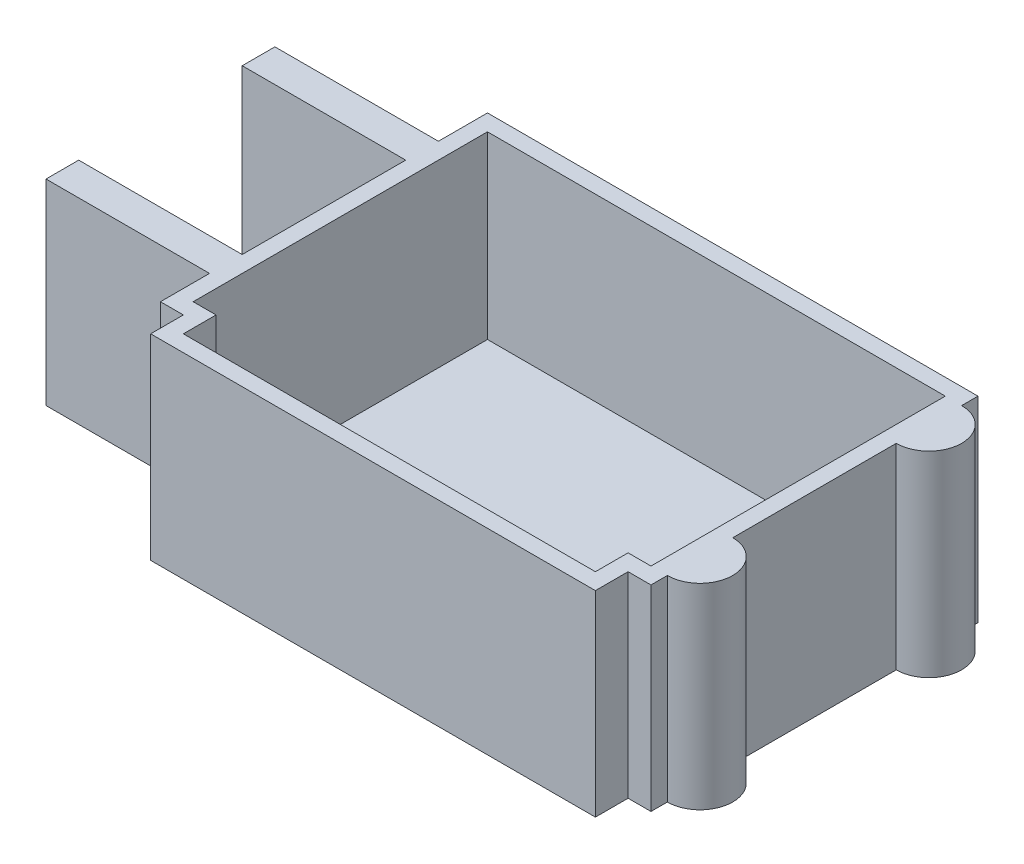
ISO-10303-21;
HEADER;
FILE_DESCRIPTION(('STEP AP214'),'2;1');
FILE_NAME('part.step','',(''),(''),'','','');
FILE_SCHEMA(('AUTOMOTIVE_DESIGN { 1 0 10303 214 1 1 1 1 }'));
ENDSEC;
DATA;
#1=APPLICATION_CONTEXT('core data for automotive mechanical design processes');
#2=APPLICATION_PROTOCOL_DEFINITION('international standard','automotive_design',2000,#1);
#3=PRODUCT_CONTEXT('',#1,'mechanical');
#4=PRODUCT('Part','Part','',(#3));
#5=PRODUCT_RELATED_PRODUCT_CATEGORY('part','',(#4));
#6=PRODUCT_DEFINITION_FORMATION('','',#4);
#7=PRODUCT_DEFINITION_CONTEXT('part definition',#1,'design');
#8=PRODUCT_DEFINITION('design','',#6,#7);
#9=PRODUCT_DEFINITION_SHAPE('','',#8);
#10=(LENGTH_UNIT() NAMED_UNIT(*) SI_UNIT(.MILLI.,.METRE.));
#11=(NAMED_UNIT(*) PLANE_ANGLE_UNIT() SI_UNIT($,.RADIAN.));
#12=(NAMED_UNIT(*) SI_UNIT($,.STERADIAN.) SOLID_ANGLE_UNIT());
#13=UNCERTAINTY_MEASURE_WITH_UNIT(LENGTH_MEASURE(1.E-05),#10,'distance_accuracy_value','');
#14=(GEOMETRIC_REPRESENTATION_CONTEXT(3) GLOBAL_UNCERTAINTY_ASSIGNED_CONTEXT((#13)) GLOBAL_UNIT_ASSIGNED_CONTEXT((#10,
#11,#12)) REPRESENTATION_CONTEXT('',''));
#15=CARTESIAN_POINT('',(0.,0.,0.));
#16=DIRECTION('',(0.,0.,1.));
#17=DIRECTION('',(1.,0.,0.));
#18=AXIS2_PLACEMENT_3D('',#15,#16,#17);
#19=CARTESIAN_POINT('',(-75.,60.,-50.));
#20=DIRECTION('',(1.,0.,0.));
#21=DIRECTION('',(0.,0.,-1.));
#22=AXIS2_PLACEMENT_3D('',#19,#20,#21);
#23=PLANE('',#22);
#24=DIRECTION('',(0.,0.,1.));
#25=VECTOR('',#24,1.);
#26=CARTESIAN_POINT('',(-75.,0.,-50.));
#27=LINE('',#26,#25);
#28=CARTESIAN_POINT('',(-75.,0.,-50.));
#29=VERTEX_POINT('',#28);
#30=CARTESIAN_POINT('',(-75.,0.,-35.));
#31=VERTEX_POINT('',#30);
#32=EDGE_CURVE('E211',#29,#31,#27,.T.);
#33=ORIENTED_EDGE('',*,*,#32,.T.);
#34=DIRECTION('',(0.,-1.,0.));
#35=VECTOR('',#34,1.);
#36=CARTESIAN_POINT('',(-75.,60.,-35.));
#37=LINE('',#36,#35);
#38=CARTESIAN_POINT('',(-75.,60.,-35.));
#39=VERTEX_POINT('',#38);
#40=EDGE_CURVE('E11',#39,#31,#37,.T.);
#41=ORIENTED_EDGE('',*,*,#40,.F.);
#42=DIRECTION('',(0.,0.,1.));
#43=VECTOR('',#42,1.);
#44=CARTESIAN_POINT('',(-75.,60.,-50.));
#45=LINE('',#44,#43);
#46=CARTESIAN_POINT('',(-75.,60.,-50.));
#47=VERTEX_POINT('',#46);
#48=EDGE_CURVE('E251',#47,#39,#45,.T.);
#49=ORIENTED_EDGE('',*,*,#48,.F.);
#50=DIRECTION('',(0.,-1.,0.));
#51=VECTOR('',#50,1.);
#52=CARTESIAN_POINT('',(-75.,60.,-50.));
#53=LINE('',#52,#51);
#54=EDGE_CURVE('E207',#47,#29,#53,.T.);
#55=ORIENTED_EDGE('',*,*,#54,.T.);
#56=EDGE_LOOP('',(#33,#41,#49,#55));
#57=FACE_BOUND('',#56,.T.);
#58=ADVANCED_FACE('F32',(#57),#23,.F.);
#59=CARTESIAN_POINT('',(-75.,60.,-35.));
#60=DIRECTION('',(0.,0.,1.));
#61=DIRECTION('',(1.,0.,0.));
#62=AXIS2_PLACEMENT_3D('',#59,#60,#61);
#63=PLANE('',#62);
#64=DIRECTION('',(-1.,0.,0.));
#65=VECTOR('',#64,1.);
#66=CARTESIAN_POINT('',(-75.,0.,-35.));
#67=LINE('',#66,#65);
#68=CARTESIAN_POINT('',(-125.,0.,-35.));
#69=VERTEX_POINT('',#68);
#70=EDGE_CURVE('E214',#31,#69,#67,.T.);
#71=ORIENTED_EDGE('',*,*,#70,.T.);
#72=DIRECTION('',(0.,-1.,0.));
#73=VECTOR('',#72,1.);
#74=CARTESIAN_POINT('',(-125.,60.,-35.));
#75=LINE('',#74,#73);
#76=CARTESIAN_POINT('',(-125.,60.,-35.));
#77=VERTEX_POINT('',#76);
#78=EDGE_CURVE('E39',#77,#69,#75,.T.);
#79=ORIENTED_EDGE('',*,*,#78,.F.);
#80=DIRECTION('',(-1.,0.,0.));
#81=VECTOR('',#80,1.);
#82=CARTESIAN_POINT('',(-75.,60.,-35.));
#83=LINE('',#82,#81);
#84=EDGE_CURVE('E132',#39,#77,#83,.T.);
#85=ORIENTED_EDGE('',*,*,#84,.F.);
#86=ORIENTED_EDGE('',*,*,#40,.T.);
#87=EDGE_LOOP('',(#71,#79,#85,#86));
#88=FACE_BOUND('',#87,.T.);
#89=ADVANCED_FACE('F504',(#88),#63,.F.);
#90=CARTESIAN_POINT('',(-125.,60.,-35.));
#91=DIRECTION('',(1.,0.,0.));
#92=DIRECTION('',(0.,0.,-1.));
#93=AXIS2_PLACEMENT_3D('',#90,#91,#92);
#94=PLANE('',#93);
#95=DIRECTION('',(0.,0.,1.));
#96=VECTOR('',#95,1.);
#97=CARTESIAN_POINT('',(-125.,0.,-35.));
#98=LINE('',#97,#96);
#99=CARTESIAN_POINT('',(-125.,0.,-25.));
#100=VERTEX_POINT('',#99);
#101=EDGE_CURVE('E217',#69,#100,#98,.T.);
#102=ORIENTED_EDGE('',*,*,#101,.T.);
#103=DIRECTION('',(0.,-1.,0.));
#104=VECTOR('',#103,1.);
#105=CARTESIAN_POINT('',(-125.,60.,-25.));
#106=LINE('',#105,#104);
#107=CARTESIAN_POINT('',(-125.,60.,-25.));
#108=VERTEX_POINT('',#107);
#109=EDGE_CURVE('E294',#108,#100,#106,.T.);
#110=ORIENTED_EDGE('',*,*,#109,.F.);
#111=DIRECTION('',(0.,0.,1.));
#112=VECTOR('',#111,1.);
#113=CARTESIAN_POINT('',(-125.,60.,-35.));
#114=LINE('',#113,#112);
#115=EDGE_CURVE('E302',#77,#108,#114,.T.);
#116=ORIENTED_EDGE('',*,*,#115,.F.);
#117=ORIENTED_EDGE('',*,*,#78,.T.);
#118=EDGE_LOOP('',(#102,#110,#116,#117));
#119=FACE_BOUND('',#118,.T.);
#120=ADVANCED_FACE('F300',(#119),#94,.F.);
#121=CARTESIAN_POINT('',(-75.,60.,-25.));
#122=DIRECTION('',(0.,0.,-1.));
#123=DIRECTION('',(-1.,0.,0.));
#124=AXIS2_PLACEMENT_3D('',#121,#122,#123);
#125=PLANE('',#124);
#126=DIRECTION('',(1.,0.,0.));
#127=VECTOR('',#126,1.);
#128=CARTESIAN_POINT('',(-75.,0.,-25.));
#129=LINE('',#128,#127);
#130=CARTESIAN_POINT('',(-75.,0.,-25.));
#131=VERTEX_POINT('',#130);
#132=EDGE_CURVE('E219',#100,#131,#129,.T.);
#133=ORIENTED_EDGE('',*,*,#132,.T.);
#134=DIRECTION('',(0.,-1.,0.));
#135=VECTOR('',#134,1.);
#136=CARTESIAN_POINT('',(-75.,60.,-25.));
#137=LINE('',#136,#135);
#138=CARTESIAN_POINT('',(-75.,60.,-25.));
#139=VERTEX_POINT('',#138);
#140=EDGE_CURVE('E291',#139,#131,#137,.T.);
#141=ORIENTED_EDGE('',*,*,#140,.F.);
#142=DIRECTION('',(1.,0.,0.));
#143=VECTOR('',#142,1.);
#144=CARTESIAN_POINT('',(-75.,60.,-25.));
#145=LINE('',#144,#143);
#146=EDGE_CURVE('E320',#108,#139,#145,.T.);
#147=ORIENTED_EDGE('',*,*,#146,.F.);
#148=ORIENTED_EDGE('',*,*,#109,.T.);
#149=EDGE_LOOP('',(#133,#141,#147,#148));
#150=FACE_BOUND('',#149,.T.);
#151=ADVANCED_FACE('F311',(#150),#125,.F.);
#152=CARTESIAN_POINT('',(-75.,60.,-25.));
#153=DIRECTION('',(1.,0.,0.));
#154=DIRECTION('',(0.,0.,-1.));
#155=AXIS2_PLACEMENT_3D('',#152,#153,#154);
#156=PLANE('',#155);
#157=DIRECTION('',(0.,0.,1.));
#158=VECTOR('',#157,1.);
#159=CARTESIAN_POINT('',(-75.,0.,-25.));
#160=LINE('',#159,#158);
#161=CARTESIAN_POINT('',(-75.,0.,25.));
#162=VERTEX_POINT('',#161);
#163=EDGE_CURVE('E221',#131,#162,#160,.T.);
#164=ORIENTED_EDGE('',*,*,#163,.T.);
#165=DIRECTION('',(0.,-1.,0.));
#166=VECTOR('',#165,1.);
#167=CARTESIAN_POINT('',(-75.,60.,25.));
#168=LINE('',#167,#166);
#169=CARTESIAN_POINT('',(-75.,60.,25.));
#170=VERTEX_POINT('',#169);
#171=EDGE_CURVE('E288',#170,#162,#168,.T.);
#172=ORIENTED_EDGE('',*,*,#171,.F.);
#173=DIRECTION('',(0.,0.,1.));
#174=VECTOR('',#173,1.);
#175=CARTESIAN_POINT('',(-75.,60.,-25.));
#176=LINE('',#175,#174);
#177=EDGE_CURVE('E317',#139,#170,#176,.T.);
#178=ORIENTED_EDGE('',*,*,#177,.F.);
#179=ORIENTED_EDGE('',*,*,#140,.T.);
#180=EDGE_LOOP('',(#164,#172,#178,#179));
#181=FACE_BOUND('',#180,.T.);
#182=ADVANCED_FACE('F315',(#181),#156,.F.);
#183=CARTESIAN_POINT('',(-75.,60.,25.));
#184=DIRECTION('',(0.,0.,1.));
#185=DIRECTION('',(1.,0.,0.));
#186=AXIS2_PLACEMENT_3D('',#183,#184,#185);
#187=PLANE('',#186);
#188=DIRECTION('',(-1.,0.,0.));
#189=VECTOR('',#188,1.);
#190=CARTESIAN_POINT('',(-75.,0.,25.));
#191=LINE('',#190,#189);
#192=CARTESIAN_POINT('',(-125.,0.,25.));
#193=VERTEX_POINT('',#192);
#194=EDGE_CURVE('E223',#162,#193,#191,.T.);
#195=ORIENTED_EDGE('',*,*,#194,.T.);
#196=DIRECTION('',(0.,-1.,0.));
#197=VECTOR('',#196,1.);
#198=CARTESIAN_POINT('',(-125.,60.,25.));
#199=LINE('',#198,#197);
#200=CARTESIAN_POINT('',(-125.,60.,25.));
#201=VERTEX_POINT('',#200);
#202=EDGE_CURVE('E285',#201,#193,#199,.T.);
#203=ORIENTED_EDGE('',*,*,#202,.F.);
#204=DIRECTION('',(-1.,0.,0.));
#205=VECTOR('',#204,1.);
#206=CARTESIAN_POINT('',(-75.,60.,25.));
#207=LINE('',#206,#205);
#208=EDGE_CURVE('E319',#170,#201,#207,.T.);
#209=ORIENTED_EDGE('',*,*,#208,.F.);
#210=ORIENTED_EDGE('',*,*,#171,.T.);
#211=EDGE_LOOP('',(#195,#203,#209,#210));
#212=FACE_BOUND('',#211,.T.);
#213=ADVANCED_FACE('F517',(#212),#187,.F.);
#214=CARTESIAN_POINT('',(-125.,60.,35.));
#215=DIRECTION('',(1.,0.,0.));
#216=DIRECTION('',(0.,0.,-1.));
#217=AXIS2_PLACEMENT_3D('',#214,#215,#216);
#218=PLANE('',#217);
#219=DIRECTION('',(0.,0.,1.));
#220=VECTOR('',#219,1.);
#221=CARTESIAN_POINT('',(-125.,0.,35.));
#222=LINE('',#221,#220);
#223=CARTESIAN_POINT('',(-125.,0.,35.));
#224=VERTEX_POINT('',#223);
#225=EDGE_CURVE('E225',#193,#224,#222,.T.);
#226=ORIENTED_EDGE('',*,*,#225,.T.);
#227=DIRECTION('',(0.,-1.,0.));
#228=VECTOR('',#227,1.);
#229=CARTESIAN_POINT('',(-125.,60.,35.));
#230=LINE('',#229,#228);
#231=CARTESIAN_POINT('',(-125.,60.,35.));
#232=VERTEX_POINT('',#231);
#233=EDGE_CURVE('E282',#232,#224,#230,.T.);
#234=ORIENTED_EDGE('',*,*,#233,.F.);
#235=DIRECTION('',(0.,0.,1.));
#236=VECTOR('',#235,1.);
#237=CARTESIAN_POINT('',(-125.,60.,35.));
#238=LINE('',#237,#236);
#239=EDGE_CURVE('E322',#201,#232,#238,.T.);
#240=ORIENTED_EDGE('',*,*,#239,.F.);
#241=ORIENTED_EDGE('',*,*,#202,.T.);
#242=EDGE_LOOP('',(#226,#234,#240,#241));
#243=FACE_BOUND('',#242,.T.);
#244=ADVANCED_FACE('F520',(#243),#218,.F.);
#245=CARTESIAN_POINT('',(-75.,60.,35.));
#246=DIRECTION('',(0.,0.,-1.));
#247=DIRECTION('',(-1.,0.,0.));
#248=AXIS2_PLACEMENT_3D('',#245,#246,#247);
#249=PLANE('',#248);
#250=DIRECTION('',(1.,0.,0.));
#251=VECTOR('',#250,1.);
#252=CARTESIAN_POINT('',(-75.,0.,35.));
#253=LINE('',#252,#251);
#254=CARTESIAN_POINT('',(-75.,0.,35.));
#255=VERTEX_POINT('',#254);
#256=EDGE_CURVE('E227',#224,#255,#253,.T.);
#257=ORIENTED_EDGE('',*,*,#256,.T.);
#258=DIRECTION('',(0.,-1.,0.));
#259=VECTOR('',#258,1.);
#260=CARTESIAN_POINT('',(-75.,60.,35.));
#261=LINE('',#260,#259);
#262=CARTESIAN_POINT('',(-75.,60.,35.));
#263=VERTEX_POINT('',#262);
#264=EDGE_CURVE('E279',#263,#255,#261,.T.);
#265=ORIENTED_EDGE('',*,*,#264,.F.);
#266=DIRECTION('',(1.,0.,0.));
#267=VECTOR('',#266,1.);
#268=CARTESIAN_POINT('',(-75.,60.,35.));
#269=LINE('',#268,#267);
#270=EDGE_CURVE('E328',#232,#263,#269,.T.);
#271=ORIENTED_EDGE('',*,*,#270,.F.);
#272=ORIENTED_EDGE('',*,*,#233,.T.);
#273=EDGE_LOOP('',(#257,#265,#271,#272));
#274=FACE_BOUND('',#273,.T.);
#275=ADVANCED_FACE('F524',(#274),#249,.F.);
#276=CARTESIAN_POINT('',(-75.,60.,35.));
#277=DIRECTION('',(1.,0.,0.));
#278=DIRECTION('',(0.,0.,-1.));
#279=AXIS2_PLACEMENT_3D('',#276,#277,#278);
#280=PLANE('',#279);
#281=DIRECTION('',(0.,0.,1.));
#282=VECTOR('',#281,1.);
#283=CARTESIAN_POINT('',(-75.,0.,35.));
#284=LINE('',#283,#282);
#285=CARTESIAN_POINT('',(-75.,0.,50.));
#286=VERTEX_POINT('',#285);
#287=EDGE_CURVE('E229',#255,#286,#284,.T.);
#288=ORIENTED_EDGE('',*,*,#287,.T.);
#289=DIRECTION('',(0.,-1.,0.));
#290=VECTOR('',#289,1.);
#291=CARTESIAN_POINT('',(-75.,60.,50.));
#292=LINE('',#291,#290);
#293=CARTESIAN_POINT('',(-75.,60.,50.));
#294=VERTEX_POINT('',#293);
#295=EDGE_CURVE('E276',#294,#286,#292,.T.);
#296=ORIENTED_EDGE('',*,*,#295,.F.);
#297=DIRECTION('',(0.,0.,1.));
#298=VECTOR('',#297,1.);
#299=CARTESIAN_POINT('',(-75.,60.,35.));
#300=LINE('',#299,#298);
#301=EDGE_CURVE('E330',#263,#294,#300,.T.);
#302=ORIENTED_EDGE('',*,*,#301,.F.);
#303=ORIENTED_EDGE('',*,*,#264,.T.);
#304=EDGE_LOOP('',(#288,#296,#302,#303));
#305=FACE_BOUND('',#304,.T.);
#306=ADVANCED_FACE('F528',(#305),#280,.F.);
#307=CARTESIAN_POINT('',(-75.,60.,50.));
#308=DIRECTION('',(0.,0.,-1.));
#309=DIRECTION('',(-1.,0.,0.));
#310=AXIS2_PLACEMENT_3D('',#307,#308,#309);
#311=PLANE('',#310);
#312=DIRECTION('',(1.,0.,0.));
#313=VECTOR('',#312,1.);
#314=CARTESIAN_POINT('',(-75.,0.,50.));
#315=LINE('',#314,#313);
#316=CARTESIAN_POINT('',(-68.,0.,50.));
#317=VERTEX_POINT('',#316);
#318=EDGE_CURVE('E231',#286,#317,#315,.T.);
#319=ORIENTED_EDGE('',*,*,#318,.T.);
#320=DIRECTION('',(0.,-1.,0.));
#321=VECTOR('',#320,1.);
#322=CARTESIAN_POINT('',(-68.,60.,50.));
#323=LINE('',#322,#321);
#324=CARTESIAN_POINT('',(-68.,60.,50.));
#325=VERTEX_POINT('',#324);
#326=EDGE_CURVE('E273',#325,#317,#323,.T.);
#327=ORIENTED_EDGE('',*,*,#326,.F.);
#328=DIRECTION('',(1.,0.,0.));
#329=VECTOR('',#328,1.);
#330=CARTESIAN_POINT('',(-75.,60.,50.));
#331=LINE('',#330,#329);
#332=EDGE_CURVE('E332',#294,#325,#331,.T.);
#333=ORIENTED_EDGE('',*,*,#332,.F.);
#334=ORIENTED_EDGE('',*,*,#295,.T.);
#335=EDGE_LOOP('',(#319,#327,#333,#334));
#336=FACE_BOUND('',#335,.T.);
#337=ADVANCED_FACE('F532',(#336),#311,.F.);
#338=CARTESIAN_POINT('',(-68.,60.,50.));
#339=DIRECTION('',(1.,0.,0.));
#340=DIRECTION('',(0.,0.,-1.));
#341=AXIS2_PLACEMENT_3D('',#338,#339,#340);
#342=PLANE('',#341);
#343=DIRECTION('',(0.,0.,1.));
#344=VECTOR('',#343,1.);
#345=CARTESIAN_POINT('',(-68.,0.,50.));
#346=LINE('',#345,#344);
#347=CARTESIAN_POINT('',(-68.,0.,60.));
#348=VERTEX_POINT('',#347);
#349=EDGE_CURVE('E233',#317,#348,#346,.T.);
#350=ORIENTED_EDGE('',*,*,#349,.T.);
#351=DIRECTION('',(0.,-1.,0.));
#352=VECTOR('',#351,1.);
#353=CARTESIAN_POINT('',(-68.,60.,60.));
#354=LINE('',#353,#352);
#355=CARTESIAN_POINT('',(-68.,60.,60.));
#356=VERTEX_POINT('',#355);
#357=EDGE_CURVE('E270',#356,#348,#354,.T.);
#358=ORIENTED_EDGE('',*,*,#357,.F.);
#359=DIRECTION('',(0.,0.,1.));
#360=VECTOR('',#359,1.);
#361=CARTESIAN_POINT('',(-68.,60.,50.));
#362=LINE('',#361,#360);
#363=EDGE_CURVE('E334',#325,#356,#362,.T.);
#364=ORIENTED_EDGE('',*,*,#363,.F.);
#365=ORIENTED_EDGE('',*,*,#326,.T.);
#366=EDGE_LOOP('',(#350,#358,#364,#365));
#367=FACE_BOUND('',#366,.T.);
#368=ADVANCED_FACE('F536',(#367),#342,.F.);
#369=CARTESIAN_POINT('',(-68.,60.,60.));
#370=DIRECTION('',(0.,0.,-1.));
#371=DIRECTION('',(-1.,0.,0.));
#372=AXIS2_PLACEMENT_3D('',#369,#370,#371);
#373=PLANE('',#372);
#374=DIRECTION('',(1.,0.,0.));
#375=VECTOR('',#374,1.);
#376=CARTESIAN_POINT('',(-68.,0.,60.));
#377=LINE('',#376,#375);
#378=CARTESIAN_POINT('',(68.,0.,60.));
#379=VERTEX_POINT('',#378);
#380=EDGE_CURVE('E235',#348,#379,#377,.T.);
#381=ORIENTED_EDGE('',*,*,#380,.T.);
#382=DIRECTION('',(0.,-1.,0.));
#383=VECTOR('',#382,1.);
#384=CARTESIAN_POINT('',(68.,60.,60.));
#385=LINE('',#384,#383);
#386=CARTESIAN_POINT('',(68.,60.,60.));
#387=VERTEX_POINT('',#386);
#388=EDGE_CURVE('E267',#387,#379,#385,.T.);
#389=ORIENTED_EDGE('',*,*,#388,.F.);
#390=DIRECTION('',(1.,0.,0.));
#391=VECTOR('',#390,1.);
#392=CARTESIAN_POINT('',(-68.,60.,60.));
#393=LINE('',#392,#391);
#394=EDGE_CURVE('E336',#356,#387,#393,.T.);
#395=ORIENTED_EDGE('',*,*,#394,.F.);
#396=ORIENTED_EDGE('',*,*,#357,.T.);
#397=EDGE_LOOP('',(#381,#389,#395,#396));
#398=FACE_BOUND('',#397,.T.);
#399=ADVANCED_FACE('F540',(#398),#373,.F.);
#400=CARTESIAN_POINT('',(68.,60.,50.));
#401=DIRECTION('',(-1.,0.,0.));
#402=DIRECTION('',(0.,0.,1.));
#403=AXIS2_PLACEMENT_3D('',#400,#401,#402);
#404=PLANE('',#403);
#405=DIRECTION('',(0.,0.,-1.));
#406=VECTOR('',#405,1.);
#407=CARTESIAN_POINT('',(68.,0.,50.));
#408=LINE('',#407,#406);
#409=CARTESIAN_POINT('',(68.,0.,50.));
#410=VERTEX_POINT('',#409);
#411=EDGE_CURVE('E237',#379,#410,#408,.T.);
#412=ORIENTED_EDGE('',*,*,#411,.T.);
#413=DIRECTION('',(0.,-1.,0.));
#414=VECTOR('',#413,1.);
#415=CARTESIAN_POINT('',(68.,60.,50.));
#416=LINE('',#415,#414);
#417=CARTESIAN_POINT('',(68.,60.,50.));
#418=VERTEX_POINT('',#417);
#419=EDGE_CURVE('E264',#418,#410,#416,.T.);
#420=ORIENTED_EDGE('',*,*,#419,.F.);
#421=DIRECTION('',(0.,0.,-1.));
#422=VECTOR('',#421,1.);
#423=CARTESIAN_POINT('',(68.,60.,50.));
#424=LINE('',#423,#422);
#425=EDGE_CURVE('E338',#387,#418,#424,.T.);
#426=ORIENTED_EDGE('',*,*,#425,.F.);
#427=ORIENTED_EDGE('',*,*,#388,.T.);
#428=EDGE_LOOP('',(#412,#420,#426,#427));
#429=FACE_BOUND('',#428,.T.);
#430=ADVANCED_FACE('F544',(#429),#404,.F.);
#431=CARTESIAN_POINT('',(68.,60.,50.));
#432=DIRECTION('',(0.,0.,-1.));
#433=DIRECTION('',(-1.,0.,0.));
#434=AXIS2_PLACEMENT_3D('',#431,#432,#433);
#435=PLANE('',#434);
#436=DIRECTION('',(1.,0.,0.));
#437=VECTOR('',#436,1.);
#438=CARTESIAN_POINT('',(68.,0.,50.));
#439=LINE('',#438,#437);
#440=CARTESIAN_POINT('',(75.,0.,50.));
#441=VERTEX_POINT('',#440);
#442=EDGE_CURVE('E239',#410,#441,#439,.T.);
#443=ORIENTED_EDGE('',*,*,#442,.T.);
#444=DIRECTION('',(0.,-1.,0.));
#445=VECTOR('',#444,1.);
#446=CARTESIAN_POINT('',(75.,60.,50.));
#447=LINE('',#446,#445);
#448=CARTESIAN_POINT('',(75.,60.,50.));
#449=VERTEX_POINT('',#448);
#450=EDGE_CURVE('E261',#449,#441,#447,.T.);
#451=ORIENTED_EDGE('',*,*,#450,.F.);
#452=DIRECTION('',(1.,0.,0.));
#453=VECTOR('',#452,1.);
#454=CARTESIAN_POINT('',(68.,60.,50.));
#455=LINE('',#454,#453);
#456=EDGE_CURVE('E340',#418,#449,#455,.T.);
#457=ORIENTED_EDGE('',*,*,#456,.F.);
#458=ORIENTED_EDGE('',*,*,#419,.T.);
#459=EDGE_LOOP('',(#443,#451,#457,#458));
#460=FACE_BOUND('',#459,.T.);
#461=ADVANCED_FACE('F548',(#460),#435,.F.);
#462=CARTESIAN_POINT('',(75.,60.,45.));
#463=DIRECTION('',(-1.,0.,0.));
#464=DIRECTION('',(0.,0.,1.));
#465=AXIS2_PLACEMENT_3D('',#462,#463,#464);
#466=PLANE('',#465);
#467=DIRECTION('',(0.,0.,-1.));
#468=VECTOR('',#467,1.);
#469=CARTESIAN_POINT('',(75.,0.,45.));
#470=LINE('',#469,#468);
#471=CARTESIAN_POINT('',(75.,0.,45.));
#472=VERTEX_POINT('',#471);
#473=EDGE_CURVE('E241',#441,#472,#470,.T.);
#474=ORIENTED_EDGE('',*,*,#473,.T.);
#475=DIRECTION('',(0.,-1.,0.));
#476=VECTOR('',#475,1.);
#477=CARTESIAN_POINT('',(75.,60.,45.));
#478=LINE('',#477,#476);
#479=CARTESIAN_POINT('',(75.,60.,45.));
#480=VERTEX_POINT('',#479);
#481=EDGE_CURVE('E258',#480,#472,#478,.T.);
#482=ORIENTED_EDGE('',*,*,#481,.F.);
#483=DIRECTION('',(0.,0.,-1.));
#484=VECTOR('',#483,1.);
#485=CARTESIAN_POINT('',(75.,60.,45.));
#486=LINE('',#485,#484);
#487=EDGE_CURVE('E342',#449,#480,#486,.T.);
#488=ORIENTED_EDGE('',*,*,#487,.F.);
#489=ORIENTED_EDGE('',*,*,#450,.T.);
#490=EDGE_LOOP('',(#474,#482,#488,#489));
#491=FACE_BOUND('',#490,.T.);
#492=ADVANCED_FACE('F552',(#491),#466,.F.);
#493=CARTESIAN_POINT('',(75.,60.,35.));
#494=DIRECTION('',(0.,-1.,0.));
#495=DIRECTION('',(0.,0.,-1.));
#496=AXIS2_PLACEMENT_3D('',#493,#494,#495);
#497=CYLINDRICAL_SURFACE('',#496,10.);
#498=CARTESIAN_POINT('',(75.,0.,35.));
#499=DIRECTION('',(0.,1.,0.));
#500=DIRECTION('',(0.,0.,1.));
#501=AXIS2_PLACEMENT_3D('',#498,#499,#500);
#502=CIRCLE('',#501,10.);
#503=CARTESIAN_POINT('',(75.,0.,25.));
#504=VERTEX_POINT('',#503);
#505=EDGE_CURVE('E243',#472,#504,#502,.T.);
#506=ORIENTED_EDGE('',*,*,#505,.T.);
#507=DIRECTION('',(0.,-1.,0.));
#508=VECTOR('',#507,1.);
#509=CARTESIAN_POINT('',(75.,60.,25.));
#510=LINE('',#509,#508);
#511=CARTESIAN_POINT('',(75.,60.,25.));
#512=VERTEX_POINT('',#511);
#513=EDGE_CURVE('E255',#512,#504,#510,.T.);
#514=ORIENTED_EDGE('',*,*,#513,.F.);
#515=CARTESIAN_POINT('',(75.,60.,35.));
#516=DIRECTION('',(0.,1.,0.));
#517=DIRECTION('',(0.,0.,1.));
#518=AXIS2_PLACEMENT_3D('',#515,#516,#517);
#519=CIRCLE('',#518,10.);
#520=EDGE_CURVE('E344',#480,#512,#519,.T.);
#521=ORIENTED_EDGE('',*,*,#520,.F.);
#522=ORIENTED_EDGE('',*,*,#481,.T.);
#523=EDGE_LOOP('',(#506,#514,#521,#522));
#524=FACE_BOUND('',#523,.T.);
#525=ADVANCED_FACE('F350',(#524),#497,.T.);
#526=CARTESIAN_POINT('',(75.,60.,-25.));
#527=DIRECTION('',(-1.,0.,0.));
#528=DIRECTION('',(0.,0.,1.));
#529=AXIS2_PLACEMENT_3D('',#526,#527,#528);
#530=PLANE('',#529);
#531=DIRECTION('',(0.,0.,-1.));
#532=VECTOR('',#531,1.);
#533=CARTESIAN_POINT('',(75.,0.,-25.));
#534=LINE('',#533,#532);
#535=CARTESIAN_POINT('',(75.,0.,-25.));
#536=VERTEX_POINT('',#535);
#537=EDGE_CURVE('E245',#504,#536,#534,.T.);
#538=ORIENTED_EDGE('',*,*,#537,.T.);
#539=DIRECTION('',(0.,-1.,0.));
#540=VECTOR('',#539,1.);
#541=CARTESIAN_POINT('',(75.,60.,-25.));
#542=LINE('',#541,#540);
#543=CARTESIAN_POINT('',(75.,60.,-25.));
#544=VERTEX_POINT('',#543);
#545=EDGE_CURVE('E202',#544,#536,#542,.T.);
#546=ORIENTED_EDGE('',*,*,#545,.F.);
#547=DIRECTION('',(0.,0.,-1.));
#548=VECTOR('',#547,1.);
#549=CARTESIAN_POINT('',(75.,60.,-25.));
#550=LINE('',#549,#548);
#551=EDGE_CURVE('E190',#512,#544,#550,.T.);
#552=ORIENTED_EDGE('',*,*,#551,.F.);
#553=ORIENTED_EDGE('',*,*,#513,.T.);
#554=EDGE_LOOP('',(#538,#546,#552,#553));
#555=FACE_BOUND('',#554,.T.);
#556=ADVANCED_FACE('F354',(#555),#530,.F.);
#557=CARTESIAN_POINT('',(75.,60.,-35.));
#558=DIRECTION('',(0.,-1.,0.));
#559=DIRECTION('',(0.,0.,-1.));
#560=AXIS2_PLACEMENT_3D('',#557,#558,#559);
#561=CYLINDRICAL_SURFACE('',#560,10.);
#562=CARTESIAN_POINT('',(75.,0.,-35.));
#563=DIRECTION('',(0.,1.,0.));
#564=DIRECTION('',(0.,0.,-1.));
#565=AXIS2_PLACEMENT_3D('',#562,#563,#564);
#566=CIRCLE('',#565,10.);
#567=CARTESIAN_POINT('',(75.,0.,-45.));
#568=VERTEX_POINT('',#567);
#569=EDGE_CURVE('E199',#536,#568,#566,.T.);
#570=ORIENTED_EDGE('',*,*,#569,.T.);
#571=DIRECTION('',(0.,-1.,0.));
#572=VECTOR('',#571,1.);
#573=CARTESIAN_POINT('',(75.,60.,-45.));
#574=LINE('',#573,#572);
#575=CARTESIAN_POINT('',(75.,60.,-45.));
#576=VERTEX_POINT('',#575);
#577=EDGE_CURVE('E196',#576,#568,#574,.T.);
#578=ORIENTED_EDGE('',*,*,#577,.F.);
#579=CARTESIAN_POINT('',(75.,60.,-35.));
#580=DIRECTION('',(0.,1.,0.));
#581=DIRECTION('',(0.,0.,-1.));
#582=AXIS2_PLACEMENT_3D('',#579,#580,#581);
#583=CIRCLE('',#582,10.);
#584=EDGE_CURVE('E183',#544,#576,#583,.T.);
#585=ORIENTED_EDGE('',*,*,#584,.F.);
#586=ORIENTED_EDGE('',*,*,#545,.T.);
#587=EDGE_LOOP('',(#570,#578,#585,#586));
#588=FACE_BOUND('',#587,.T.);
#589=ADVANCED_FACE('F197',(#588),#561,.T.);
#590=CARTESIAN_POINT('',(75.,60.,-50.));
#591=DIRECTION('',(-1.,0.,0.));
#592=DIRECTION('',(0.,0.,1.));
#593=AXIS2_PLACEMENT_3D('',#590,#591,#592);
#594=PLANE('',#593);
#595=DIRECTION('',(0.,0.,-1.));
#596=VECTOR('',#595,1.);
#597=CARTESIAN_POINT('',(75.,0.,-50.));
#598=LINE('',#597,#596);
#599=CARTESIAN_POINT('',(75.,0.,-50.));
#600=VERTEX_POINT('',#599);
#601=EDGE_CURVE('E248',#568,#600,#598,.T.);
#602=ORIENTED_EDGE('',*,*,#601,.T.);
#603=DIRECTION('',(0.,-1.,0.));
#604=VECTOR('',#603,1.);
#605=CARTESIAN_POINT('',(75.,60.,-50.));
#606=LINE('',#605,#604);
#607=CARTESIAN_POINT('',(75.,60.,-50.));
#608=VERTEX_POINT('',#607);
#609=EDGE_CURVE('E203',#608,#600,#606,.T.);
#610=ORIENTED_EDGE('',*,*,#609,.F.);
#611=DIRECTION('',(0.,0.,-1.));
#612=VECTOR('',#611,1.);
#613=CARTESIAN_POINT('',(75.,60.,-50.));
#614=LINE('',#613,#612);
#615=EDGE_CURVE('E187',#576,#608,#614,.T.);
#616=ORIENTED_EDGE('',*,*,#615,.F.);
#617=ORIENTED_EDGE('',*,*,#577,.T.);
#618=EDGE_LOOP('',(#602,#610,#616,#617));
#619=FACE_BOUND('',#618,.T.);
#620=ADVANCED_FACE('F205',(#619),#594,.F.);
#621=CARTESIAN_POINT('',(-75.,60.,-50.));
#622=DIRECTION('',(0.,0.,1.));
#623=DIRECTION('',(1.,0.,0.));
#624=AXIS2_PLACEMENT_3D('',#621,#622,#623);
#625=PLANE('',#624);
#626=DIRECTION('',(-1.,0.,0.));
#627=VECTOR('',#626,1.);
#628=CARTESIAN_POINT('',(-75.,0.,-50.));
#629=LINE('',#628,#627);
#630=EDGE_CURVE('E124',#600,#29,#629,.T.);
#631=ORIENTED_EDGE('',*,*,#630,.T.);
#632=ORIENTED_EDGE('',*,*,#54,.F.);
#633=DIRECTION('',(-1.,0.,0.));
#634=VECTOR('',#633,1.);
#635=CARTESIAN_POINT('',(-75.,60.,-50.));
#636=LINE('',#635,#634);
#637=EDGE_CURVE('E55',#608,#47,#636,.T.);
#638=ORIENTED_EDGE('',*,*,#637,.F.);
#639=ORIENTED_EDGE('',*,*,#609,.T.);
#640=EDGE_LOOP('',(#631,#632,#638,#639));
#641=FACE_BOUND('',#640,.T.);
#642=ADVANCED_FACE('F355',(#641),#625,.F.);
#643=CARTESIAN_POINT('',(75.,60.,35.));
#644=DIRECTION('',(0.,1.,0.));
#645=DIRECTION('',(0.,0.,1.));
#646=AXIS2_PLACEMENT_3D('',#643,#644,#645);
#647=PLANE('',#646);
#648=DIRECTION('',(0.,0.,1.));
#649=VECTOR('',#648,1.);
#650=CARTESIAN_POINT('',(-70.,60.,-50.));
#651=LINE('',#650,#649);
#652=CARTESIAN_POINT('',(-70.,60.,-45.));
#653=VERTEX_POINT('',#652);
#654=CARTESIAN_POINT('',(-70.,60.,45.));
#655=VERTEX_POINT('',#654);
#656=EDGE_CURVE('E382',#653,#655,#651,.T.);
#657=ORIENTED_EDGE('',*,*,#656,.F.);
#658=DIRECTION('',(-1.,0.,0.));
#659=VECTOR('',#658,1.);
#660=CARTESIAN_POINT('',(-75.,60.,-45.));
#661=LINE('',#660,#659);
#662=CARTESIAN_POINT('',(70.,60.,-45.));
#663=VERTEX_POINT('',#662);
#664=EDGE_CURVE('E362',#663,#653,#661,.T.);
#665=ORIENTED_EDGE('',*,*,#664,.F.);
#666=DIRECTION('',(0.,0.,-1.));
#667=VECTOR('',#666,1.);
#668=CARTESIAN_POINT('',(70.,60.,45.));
#669=LINE('',#668,#667);
#670=CARTESIAN_POINT('',(70.,60.,45.));
#671=VERTEX_POINT('',#670);
#672=EDGE_CURVE('E365',#671,#663,#669,.T.);
#673=ORIENTED_EDGE('',*,*,#672,.F.);
#674=DIRECTION('',(1.,0.,0.));
#675=VECTOR('',#674,1.);
#676=CARTESIAN_POINT('',(68.,60.,45.));
#677=LINE('',#676,#675);
#678=CARTESIAN_POINT('',(63.,60.,45.));
#679=VERTEX_POINT('',#678);
#680=EDGE_CURVE('E367',#679,#671,#677,.T.);
#681=ORIENTED_EDGE('',*,*,#680,.F.);
#682=DIRECTION('',(0.,0.,-1.));
#683=VECTOR('',#682,1.);
#684=CARTESIAN_POINT('',(63.,60.,50.));
#685=LINE('',#684,#683);
#686=CARTESIAN_POINT('',(63.,60.,55.));
#687=VERTEX_POINT('',#686);
#688=EDGE_CURVE('E370',#687,#679,#685,.T.);
#689=ORIENTED_EDGE('',*,*,#688,.F.);
#690=DIRECTION('',(1.,0.,0.));
#691=VECTOR('',#690,1.);
#692=CARTESIAN_POINT('',(-68.,60.,55.));
#693=LINE('',#692,#691);
#694=CARTESIAN_POINT('',(-63.,60.,55.));
#695=VERTEX_POINT('',#694);
#696=EDGE_CURVE('E373',#695,#687,#693,.T.);
#697=ORIENTED_EDGE('',*,*,#696,.F.);
#698=DIRECTION('',(0.,0.,1.));
#699=VECTOR('',#698,1.);
#700=CARTESIAN_POINT('',(-63.,60.,50.));
#701=LINE('',#700,#699);
#702=CARTESIAN_POINT('',(-63.,60.,45.));
#703=VERTEX_POINT('',#702);
#704=EDGE_CURVE('E376',#703,#695,#701,.T.);
#705=ORIENTED_EDGE('',*,*,#704,.F.);
#706=DIRECTION('',(1.,0.,0.));
#707=VECTOR('',#706,1.);
#708=CARTESIAN_POINT('',(-75.,60.,45.));
#709=LINE('',#708,#707);
#710=EDGE_CURVE('E379',#655,#703,#709,.T.);
#711=ORIENTED_EDGE('',*,*,#710,.F.);
#712=EDGE_LOOP('',(#657,#665,#673,#681,#689,#697,#705,#711));
#713=FACE_BOUND('',#712,.T.);
#714=ORIENTED_EDGE('',*,*,#48,.T.);
#715=ORIENTED_EDGE('',*,*,#84,.T.);
#716=ORIENTED_EDGE('',*,*,#115,.T.);
#717=ORIENTED_EDGE('',*,*,#146,.T.);
#718=ORIENTED_EDGE('',*,*,#177,.T.);
#719=ORIENTED_EDGE('',*,*,#208,.T.);
#720=ORIENTED_EDGE('',*,*,#239,.T.);
#721=ORIENTED_EDGE('',*,*,#270,.T.);
#722=ORIENTED_EDGE('',*,*,#301,.T.);
#723=ORIENTED_EDGE('',*,*,#332,.T.);
#724=ORIENTED_EDGE('',*,*,#363,.T.);
#725=ORIENTED_EDGE('',*,*,#394,.T.);
#726=ORIENTED_EDGE('',*,*,#425,.T.);
#727=ORIENTED_EDGE('',*,*,#456,.T.);
#728=ORIENTED_EDGE('',*,*,#487,.T.);
#729=ORIENTED_EDGE('',*,*,#520,.T.);
#730=ORIENTED_EDGE('',*,*,#551,.T.);
#731=ORIENTED_EDGE('',*,*,#584,.T.);
#732=ORIENTED_EDGE('',*,*,#615,.T.);
#733=ORIENTED_EDGE('',*,*,#637,.T.);
#734=EDGE_LOOP('',(#714,#715,#716,#717,#718,#719,#720,#721,#722,#723,#724,#725,#726,#727,#728,
#729,#730,#731,#732,#733));
#735=FACE_BOUND('',#734,.T.);
#736=ADVANCED_FACE('F185',(#713,#735),#647,.T.);
#737=CARTESIAN_POINT('',(75.,0.,35.));
#738=DIRECTION('',(0.,1.,0.));
#739=DIRECTION('',(0.,0.,1.));
#740=AXIS2_PLACEMENT_3D('',#737,#738,#739);
#741=PLANE('',#740);
#742=ORIENTED_EDGE('',*,*,#32,.F.);
#743=ORIENTED_EDGE('',*,*,#630,.F.);
#744=ORIENTED_EDGE('',*,*,#601,.F.);
#745=ORIENTED_EDGE('',*,*,#569,.F.);
#746=ORIENTED_EDGE('',*,*,#537,.F.);
#747=ORIENTED_EDGE('',*,*,#505,.F.);
#748=ORIENTED_EDGE('',*,*,#473,.F.);
#749=ORIENTED_EDGE('',*,*,#442,.F.);
#750=ORIENTED_EDGE('',*,*,#411,.F.);
#751=ORIENTED_EDGE('',*,*,#380,.F.);
#752=ORIENTED_EDGE('',*,*,#349,.F.);
#753=ORIENTED_EDGE('',*,*,#318,.F.);
#754=ORIENTED_EDGE('',*,*,#287,.F.);
#755=ORIENTED_EDGE('',*,*,#256,.F.);
#756=ORIENTED_EDGE('',*,*,#225,.F.);
#757=ORIENTED_EDGE('',*,*,#194,.F.);
#758=ORIENTED_EDGE('',*,*,#163,.F.);
#759=ORIENTED_EDGE('',*,*,#132,.F.);
#760=ORIENTED_EDGE('',*,*,#101,.F.);
#761=ORIENTED_EDGE('',*,*,#70,.F.);
#762=EDGE_LOOP('',(#742,#743,#744,#745,#746,#747,#748,#749,#750,#751,#752,#753,#754,#755,#756,
#757,#758,#759,#760,#761));
#763=FACE_BOUND('',#762,.T.);
#764=ADVANCED_FACE('F306',(#763),#741,.F.);
#765=CARTESIAN_POINT('',(-70.,60.,35.));
#766=DIRECTION('',(1.,0.,0.));
#767=DIRECTION('',(0.,0.,-1.));
#768=AXIS2_PLACEMENT_3D('',#765,#766,#767);
#769=PLANE('',#768);
#770=DIRECTION('',(0.,0.,1.));
#771=VECTOR('',#770,1.);
#772=CARTESIAN_POINT('',(-70.,5.,35.));
#773=LINE('',#772,#771);
#774=CARTESIAN_POINT('',(-70.,5.,-45.));
#775=VERTEX_POINT('',#774);
#776=CARTESIAN_POINT('',(-70.,5.,45.));
#777=VERTEX_POINT('',#776);
#778=EDGE_CURVE('E422',#775,#777,#773,.T.);
#779=ORIENTED_EDGE('',*,*,#778,.F.);
#780=DIRECTION('',(0.,-1.,0.));
#781=VECTOR('',#780,1.);
#782=CARTESIAN_POINT('',(-70.,60.,-45.));
#783=LINE('',#782,#781);
#784=EDGE_CURVE('E364',#653,#775,#783,.T.);
#785=ORIENTED_EDGE('',*,*,#784,.F.);
#786=ORIENTED_EDGE('',*,*,#656,.T.);
#787=DIRECTION('',(0.,-1.,0.));
#788=VECTOR('',#787,1.);
#789=CARTESIAN_POINT('',(-70.,60.,45.));
#790=LINE('',#789,#788);
#791=EDGE_CURVE('E215',#655,#777,#790,.T.);
#792=ORIENTED_EDGE('',*,*,#791,.T.);
#793=EDGE_LOOP('',(#779,#785,#786,#792));
#794=FACE_BOUND('',#793,.T.);
#795=ADVANCED_FACE('F438',(#794),#769,.T.);
#796=CARTESIAN_POINT('',(-75.,60.,45.));
#797=DIRECTION('',(0.,0.,-1.));
#798=DIRECTION('',(-1.,0.,0.));
#799=AXIS2_PLACEMENT_3D('',#796,#797,#798);
#800=PLANE('',#799);
#801=DIRECTION('',(1.,0.,0.));
#802=VECTOR('',#801,1.);
#803=CARTESIAN_POINT('',(-75.,5.,45.));
#804=LINE('',#803,#802);
#805=CARTESIAN_POINT('',(-63.,5.,45.));
#806=VERTEX_POINT('',#805);
#807=EDGE_CURVE('E417',#777,#806,#804,.T.);
#808=ORIENTED_EDGE('',*,*,#807,.F.);
#809=ORIENTED_EDGE('',*,*,#791,.F.);
#810=ORIENTED_EDGE('',*,*,#710,.T.);
#811=DIRECTION('',(0.,-1.,0.));
#812=VECTOR('',#811,1.);
#813=CARTESIAN_POINT('',(-63.,60.,45.));
#814=LINE('',#813,#812);
#815=EDGE_CURVE('E414',#703,#806,#814,.T.);
#816=ORIENTED_EDGE('',*,*,#815,.T.);
#817=EDGE_LOOP('',(#808,#809,#810,#816));
#818=FACE_BOUND('',#817,.T.);
#819=ADVANCED_FACE('F451',(#818),#800,.T.);
#820=CARTESIAN_POINT('',(-63.,60.,50.));
#821=DIRECTION('',(1.,0.,0.));
#822=DIRECTION('',(0.,0.,-1.));
#823=AXIS2_PLACEMENT_3D('',#820,#821,#822);
#824=PLANE('',#823);
#825=DIRECTION('',(0.,0.,1.));
#826=VECTOR('',#825,1.);
#827=CARTESIAN_POINT('',(-63.,5.,50.));
#828=LINE('',#827,#826);
#829=CARTESIAN_POINT('',(-63.,5.,55.));
#830=VERTEX_POINT('',#829);
#831=EDGE_CURVE('E411',#806,#830,#828,.T.);
#832=ORIENTED_EDGE('',*,*,#831,.F.);
#833=ORIENTED_EDGE('',*,*,#815,.F.);
#834=ORIENTED_EDGE('',*,*,#704,.T.);
#835=DIRECTION('',(0.,-1.,0.));
#836=VECTOR('',#835,1.);
#837=CARTESIAN_POINT('',(-63.,60.,55.));
#838=LINE('',#837,#836);
#839=EDGE_CURVE('E408',#695,#830,#838,.T.);
#840=ORIENTED_EDGE('',*,*,#839,.T.);
#841=EDGE_LOOP('',(#832,#833,#834,#840));
#842=FACE_BOUND('',#841,.T.);
#843=ADVANCED_FACE('F457',(#842),#824,.T.);
#844=CARTESIAN_POINT('',(-68.,60.,55.));
#845=DIRECTION('',(0.,0.,-1.));
#846=DIRECTION('',(-1.,0.,0.));
#847=AXIS2_PLACEMENT_3D('',#844,#845,#846);
#848=PLANE('',#847);
#849=DIRECTION('',(1.,0.,0.));
#850=VECTOR('',#849,1.);
#851=CARTESIAN_POINT('',(-68.,5.,55.));
#852=LINE('',#851,#850);
#853=CARTESIAN_POINT('',(63.,5.,55.));
#854=VERTEX_POINT('',#853);
#855=EDGE_CURVE('E405',#830,#854,#852,.T.);
#856=ORIENTED_EDGE('',*,*,#855,.F.);
#857=ORIENTED_EDGE('',*,*,#839,.F.);
#858=ORIENTED_EDGE('',*,*,#696,.T.);
#859=DIRECTION('',(0.,-1.,0.));
#860=VECTOR('',#859,1.);
#861=CARTESIAN_POINT('',(63.,60.,55.));
#862=LINE('',#861,#860);
#863=EDGE_CURVE('E402',#687,#854,#862,.T.);
#864=ORIENTED_EDGE('',*,*,#863,.T.);
#865=EDGE_LOOP('',(#856,#857,#858,#864));
#866=FACE_BOUND('',#865,.T.);
#867=ADVANCED_FACE('F494',(#866),#848,.T.);
#868=CARTESIAN_POINT('',(63.,60.,50.));
#869=DIRECTION('',(-1.,0.,0.));
#870=DIRECTION('',(0.,0.,1.));
#871=AXIS2_PLACEMENT_3D('',#868,#869,#870);
#872=PLANE('',#871);
#873=DIRECTION('',(0.,0.,-1.));
#874=VECTOR('',#873,1.);
#875=CARTESIAN_POINT('',(63.,5.,50.));
#876=LINE('',#875,#874);
#877=CARTESIAN_POINT('',(63.,5.,45.));
#878=VERTEX_POINT('',#877);
#879=EDGE_CURVE('E399',#854,#878,#876,.T.);
#880=ORIENTED_EDGE('',*,*,#879,.F.);
#881=ORIENTED_EDGE('',*,*,#863,.F.);
#882=ORIENTED_EDGE('',*,*,#688,.T.);
#883=DIRECTION('',(0.,-1.,0.));
#884=VECTOR('',#883,1.);
#885=CARTESIAN_POINT('',(63.,60.,45.));
#886=LINE('',#885,#884);
#887=EDGE_CURVE('E396',#679,#878,#886,.T.);
#888=ORIENTED_EDGE('',*,*,#887,.T.);
#889=EDGE_LOOP('',(#880,#881,#882,#888));
#890=FACE_BOUND('',#889,.T.);
#891=ADVANCED_FACE('F492',(#890),#872,.T.);
#892=CARTESIAN_POINT('',(68.,60.,45.));
#893=DIRECTION('',(0.,0.,-1.));
#894=DIRECTION('',(-1.,0.,0.));
#895=AXIS2_PLACEMENT_3D('',#892,#893,#894);
#896=PLANE('',#895);
#897=DIRECTION('',(1.,0.,0.));
#898=VECTOR('',#897,1.);
#899=CARTESIAN_POINT('',(68.,5.,45.));
#900=LINE('',#899,#898);
#901=CARTESIAN_POINT('',(70.,5.,45.));
#902=VERTEX_POINT('',#901);
#903=EDGE_CURVE('E393',#878,#902,#900,.T.);
#904=ORIENTED_EDGE('',*,*,#903,.F.);
#905=ORIENTED_EDGE('',*,*,#887,.F.);
#906=ORIENTED_EDGE('',*,*,#680,.T.);
#907=DIRECTION('',(0.,-1.,0.));
#908=VECTOR('',#907,1.);
#909=CARTESIAN_POINT('',(70.,60.,45.));
#910=LINE('',#909,#908);
#911=EDGE_CURVE('E390',#671,#902,#910,.T.);
#912=ORIENTED_EDGE('',*,*,#911,.T.);
#913=EDGE_LOOP('',(#904,#905,#906,#912));
#914=FACE_BOUND('',#913,.T.);
#915=ADVANCED_FACE('F485',(#914),#896,.T.);
#916=CARTESIAN_POINT('',(70.,60.,-50.));
#917=DIRECTION('',(-1.,0.,0.));
#918=DIRECTION('',(0.,0.,1.));
#919=AXIS2_PLACEMENT_3D('',#916,#917,#918);
#920=PLANE('',#919);
#921=DIRECTION('',(0.,0.,-1.));
#922=VECTOR('',#921,1.);
#923=CARTESIAN_POINT('',(70.,5.,-50.));
#924=LINE('',#923,#922);
#925=CARTESIAN_POINT('',(70.,5.,-45.));
#926=VERTEX_POINT('',#925);
#927=EDGE_CURVE('E388',#902,#926,#924,.T.);
#928=ORIENTED_EDGE('',*,*,#927,.F.);
#929=ORIENTED_EDGE('',*,*,#911,.F.);
#930=ORIENTED_EDGE('',*,*,#672,.T.);
#931=DIRECTION('',(0.,-1.,0.));
#932=VECTOR('',#931,1.);
#933=CARTESIAN_POINT('',(70.,60.,-45.));
#934=LINE('',#933,#932);
#935=EDGE_CURVE('E46',#663,#926,#934,.T.);
#936=ORIENTED_EDGE('',*,*,#935,.T.);
#937=EDGE_LOOP('',(#928,#929,#930,#936));
#938=FACE_BOUND('',#937,.T.);
#939=ADVANCED_FACE('F488',(#938),#920,.T.);
#940=CARTESIAN_POINT('',(-75.,60.,-45.));
#941=DIRECTION('',(0.,0.,1.));
#942=DIRECTION('',(1.,0.,0.));
#943=AXIS2_PLACEMENT_3D('',#940,#941,#942);
#944=PLANE('',#943);
#945=DIRECTION('',(-1.,0.,0.));
#946=VECTOR('',#945,1.);
#947=CARTESIAN_POINT('',(-75.,5.,-45.));
#948=LINE('',#947,#946);
#949=EDGE_CURVE('E385',#926,#775,#948,.T.);
#950=ORIENTED_EDGE('',*,*,#949,.F.);
#951=ORIENTED_EDGE('',*,*,#935,.F.);
#952=ORIENTED_EDGE('',*,*,#664,.T.);
#953=ORIENTED_EDGE('',*,*,#784,.T.);
#954=EDGE_LOOP('',(#950,#951,#952,#953));
#955=FACE_BOUND('',#954,.T.);
#956=ADVANCED_FACE('F430',(#955),#944,.T.);
#957=CARTESIAN_POINT('',(75.,5.,35.));
#958=DIRECTION('',(0.,1.,0.));
#959=DIRECTION('',(0.,0.,1.));
#960=AXIS2_PLACEMENT_3D('',#957,#958,#959);
#961=PLANE('',#960);
#962=ORIENTED_EDGE('',*,*,#778,.T.);
#963=ORIENTED_EDGE('',*,*,#807,.T.);
#964=ORIENTED_EDGE('',*,*,#831,.T.);
#965=ORIENTED_EDGE('',*,*,#855,.T.);
#966=ORIENTED_EDGE('',*,*,#879,.T.);
#967=ORIENTED_EDGE('',*,*,#903,.T.);
#968=ORIENTED_EDGE('',*,*,#927,.T.);
#969=ORIENTED_EDGE('',*,*,#949,.T.);
#970=EDGE_LOOP('',(#962,#963,#964,#965,#966,#967,#968,#969));
#971=FACE_BOUND('',#970,.T.);
#972=ADVANCED_FACE('F464',(#971),#961,.T.);
#973=CLOSED_SHELL('',(#58,#89,#120,#151,#182,#213,#244,#275,#306,#337,#368,#399,#430,#461,#492,
#525,#556,#589,#620,#642,#736,#764,#795,#819,#843,#867,#891,#915,#939,#956,#972));
#974=MANIFOLD_SOLID_BREP('B2',#973);
#975=ADVANCED_BREP_SHAPE_REPRESENTATION('',(#18,#974),#14);
#976=SHAPE_DEFINITION_REPRESENTATION(#9,#975);
ENDSEC;
END-ISO-10303-21;
